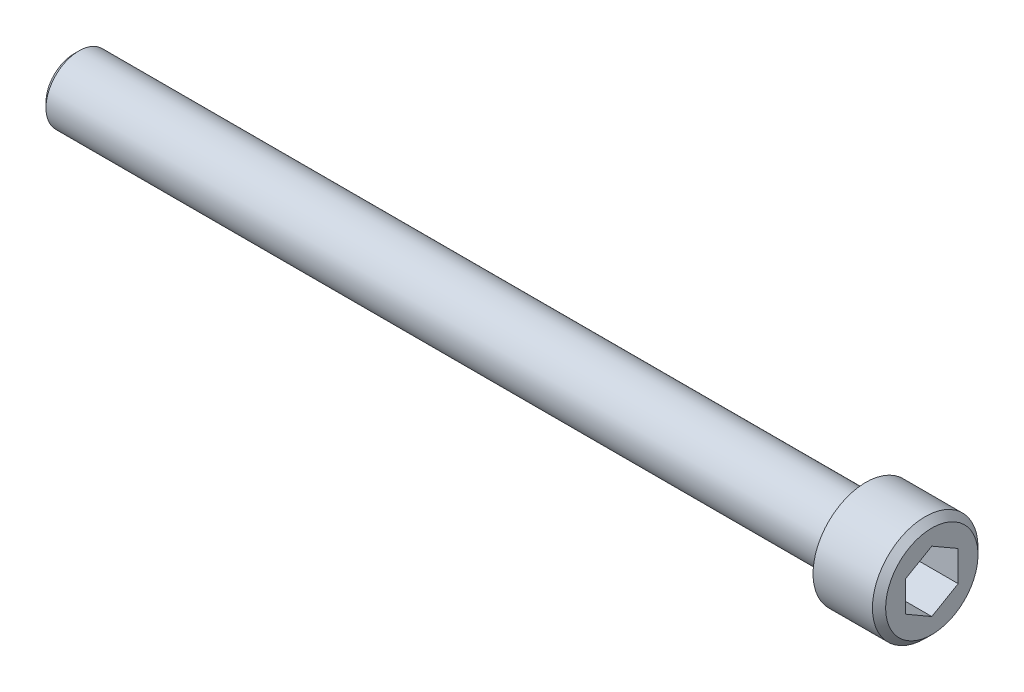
ISO-10303-21;
HEADER;
FILE_DESCRIPTION(('STEP AP214'),'2;1');
FILE_NAME('part.step','',(''),(''),'','','');
FILE_SCHEMA(('AUTOMOTIVE_DESIGN { 1 0 10303 214 1 1 1 1 }'));
ENDSEC;
DATA;
#1=APPLICATION_CONTEXT('core data for automotive mechanical design processes');
#2=APPLICATION_PROTOCOL_DEFINITION('international standard','automotive_design',2000,#1);
#3=PRODUCT_CONTEXT('',#1,'mechanical');
#4=PRODUCT('Part','Part','',(#3));
#5=PRODUCT_RELATED_PRODUCT_CATEGORY('part','',(#4));
#6=PRODUCT_DEFINITION_FORMATION('','',#4);
#7=PRODUCT_DEFINITION_CONTEXT('part definition',#1,'design');
#8=PRODUCT_DEFINITION('design','',#6,#7);
#9=PRODUCT_DEFINITION_SHAPE('','',#8);
#10=(LENGTH_UNIT() NAMED_UNIT(*) SI_UNIT(.MILLI.,.METRE.));
#11=(NAMED_UNIT(*) PLANE_ANGLE_UNIT() SI_UNIT($,.RADIAN.));
#12=(NAMED_UNIT(*) SI_UNIT($,.STERADIAN.) SOLID_ANGLE_UNIT());
#13=UNCERTAINTY_MEASURE_WITH_UNIT(LENGTH_MEASURE(1.E-05),#10,'distance_accuracy_value','');
#14=(GEOMETRIC_REPRESENTATION_CONTEXT(3) GLOBAL_UNCERTAINTY_ASSIGNED_CONTEXT((#13)) GLOBAL_UNIT_ASSIGNED_CONTEXT((#10,
#11,#12)) REPRESENTATION_CONTEXT('',''));
#15=CARTESIAN_POINT('',(0.,0.,0.));
#16=DIRECTION('',(0.,0.,1.));
#17=DIRECTION('',(1.,0.,0.));
#18=AXIS2_PLACEMENT_3D('',#15,#16,#17);
#19=CARTESIAN_POINT('',(124.,0.,0.));
#20=DIRECTION('',(1.,0.,0.));
#21=DIRECTION('',(0.,0.,-1.));
#22=AXIS2_PLACEMENT_3D('',#19,#20,#21);
#23=PLANE('',#22);
#24=DIRECTION('',(0.,-0.5,0.866025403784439));
#25=VECTOR('',#24,1.);
#26=CARTESIAN_POINT('',(124.,4.61880215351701,0.));
#27=LINE('',#26,#25);
#28=CARTESIAN_POINT('',(124.,4.61880215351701,0.));
#29=VERTEX_POINT('',#28);
#30=CARTESIAN_POINT('',(124.,2.3094010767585,4.));
#31=VERTEX_POINT('',#30);
#32=EDGE_CURVE('E83',#29,#31,#27,.T.);
#33=ORIENTED_EDGE('',*,*,#32,.T.);
#34=DIRECTION('',(0.,1.,0.));
#35=VECTOR('',#34,1.);
#36=CARTESIAN_POINT('',(124.,2.3094010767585,4.));
#37=LINE('',#36,#35);
#38=CARTESIAN_POINT('',(124.,-2.3094010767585,4.));
#39=VERTEX_POINT('',#38);
#40=EDGE_CURVE('E67',#31,#39,#37,.F.);
#41=ORIENTED_EDGE('',*,*,#40,.T.);
#42=DIRECTION('',(0.,-0.5,-0.866025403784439));
#43=VECTOR('',#42,1.);
#44=CARTESIAN_POINT('',(124.,-2.3094010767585,4.));
#45=LINE('',#44,#43);
#46=CARTESIAN_POINT('',(124.,-4.61880215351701,0.));
#47=VERTEX_POINT('',#46);
#48=EDGE_CURVE('E72',#39,#47,#45,.T.);
#49=ORIENTED_EDGE('',*,*,#48,.T.);
#50=DIRECTION('',(0.,0.5,-0.866025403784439));
#51=VECTOR('',#50,1.);
#52=CARTESIAN_POINT('',(124.,-4.61880215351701,0.));
#53=LINE('',#52,#51);
#54=CARTESIAN_POINT('',(124.,-2.3094010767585,-4.));
#55=VERTEX_POINT('',#54);
#56=EDGE_CURVE('E128',#47,#55,#53,.T.);
#57=ORIENTED_EDGE('',*,*,#56,.T.);
#58=DIRECTION('',(0.,1.,0.));
#59=VECTOR('',#58,1.);
#60=CARTESIAN_POINT('',(124.,-2.3094010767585,-4.));
#61=LINE('',#60,#59);
#62=CARTESIAN_POINT('',(124.,2.3094010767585,-4.));
#63=VERTEX_POINT('',#62);
#64=EDGE_CURVE('E132',#55,#63,#61,.T.);
#65=ORIENTED_EDGE('',*,*,#64,.T.);
#66=DIRECTION('',(0.,0.5,0.866025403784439));
#67=VECTOR('',#66,1.);
#68=CARTESIAN_POINT('',(124.,2.3094010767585,-4.));
#69=LINE('',#68,#67);
#70=EDGE_CURVE('E137',#63,#29,#69,.T.);
#71=ORIENTED_EDGE('',*,*,#70,.T.);
#72=EDGE_LOOP('',(#33,#41,#49,#57,#65,#71));
#73=FACE_BOUND('',#72,.T.);
#74=ADVANCED_FACE('F17',(#73),#23,.T.);
#75=CARTESIAN_POINT('',(130.,-2.3094010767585,4.));
#76=DIRECTION('',(0.,-0.866025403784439,0.5));
#77=DIRECTION('',(0.,-0.5,-0.866025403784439));
#78=AXIS2_PLACEMENT_3D('',#75,#76,#77);
#79=PLANE('',#78);
#80=DIRECTION('',(1.,0.,0.));
#81=VECTOR('',#80,1.);
#82=CARTESIAN_POINT('',(130.,-2.3094010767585,4.));
#83=LINE('',#82,#81);
#84=CARTESIAN_POINT('',(130.,-2.3094010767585,4.));
#85=VERTEX_POINT('',#84);
#86=EDGE_CURVE('E74',#39,#85,#83,.T.);
#87=ORIENTED_EDGE('',*,*,#86,.T.);
#88=DIRECTION('',(0.,0.5,0.866025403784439));
#89=VECTOR('',#88,1.);
#90=CARTESIAN_POINT('',(130.,-4.61880215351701,0.));
#91=LINE('',#90,#89);
#92=CARTESIAN_POINT('',(130.,-4.61880215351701,0.));
#93=VERTEX_POINT('',#92);
#94=EDGE_CURVE('E126',#93,#85,#91,.T.);
#95=ORIENTED_EDGE('',*,*,#94,.F.);
#96=DIRECTION('',(1.,0.,0.));
#97=VECTOR('',#96,1.);
#98=CARTESIAN_POINT('',(130.,-4.61880215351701,0.));
#99=LINE('',#98,#97);
#100=EDGE_CURVE('E77',#93,#47,#99,.F.);
#101=ORIENTED_EDGE('',*,*,#100,.T.);
#102=ORIENTED_EDGE('',*,*,#48,.F.);
#103=EDGE_LOOP('',(#87,#95,#101,#102));
#104=FACE_BOUND('',#103,.T.);
#105=ADVANCED_FACE('F73',(#104),#79,.F.);
#106=CARTESIAN_POINT('',(130.,2.3094010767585,4.));
#107=DIRECTION('',(0.,0.,1.));
#108=DIRECTION('',(1.,0.,0.));
#109=AXIS2_PLACEMENT_3D('',#106,#107,#108);
#110=PLANE('',#109);
#111=DIRECTION('',(1.,0.,0.));
#112=VECTOR('',#111,1.);
#113=CARTESIAN_POINT('',(130.,2.3094010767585,4.));
#114=LINE('',#113,#112);
#115=CARTESIAN_POINT('',(130.,2.3094010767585,4.));
#116=VERTEX_POINT('',#115);
#117=EDGE_CURVE('E85',#31,#116,#114,.T.);
#118=ORIENTED_EDGE('',*,*,#117,.T.);
#119=DIRECTION('',(0.,1.,0.));
#120=VECTOR('',#119,1.);
#121=CARTESIAN_POINT('',(130.,3.50000000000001,4.));
#122=LINE('',#121,#120);
#123=EDGE_CURVE('E89',#85,#116,#122,.T.);
#124=ORIENTED_EDGE('',*,*,#123,.F.);
#125=ORIENTED_EDGE('',*,*,#86,.F.);
#126=ORIENTED_EDGE('',*,*,#40,.F.);
#127=EDGE_LOOP('',(#118,#124,#125,#126));
#128=FACE_BOUND('',#127,.T.);
#129=ADVANCED_FACE('F87',(#128),#110,.F.);
#130=CARTESIAN_POINT('',(130.,4.61880215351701,0.));
#131=DIRECTION('',(0.,0.866025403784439,0.5));
#132=DIRECTION('',(0.,-0.5,0.866025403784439));
#133=AXIS2_PLACEMENT_3D('',#130,#131,#132);
#134=PLANE('',#133);
#135=DIRECTION('',(1.,0.,0.));
#136=VECTOR('',#135,1.);
#137=CARTESIAN_POINT('',(130.,4.61880215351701,0.));
#138=LINE('',#137,#136);
#139=CARTESIAN_POINT('',(130.,4.61880215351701,0.));
#140=VERTEX_POINT('',#139);
#141=EDGE_CURVE('E139',#29,#140,#138,.T.);
#142=ORIENTED_EDGE('',*,*,#141,.T.);
#143=DIRECTION('',(0.,0.5,-0.866025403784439));
#144=VECTOR('',#143,1.);
#145=CARTESIAN_POINT('',(130.,2.3094010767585,4.));
#146=LINE('',#145,#144);
#147=EDGE_CURVE('E122',#116,#140,#146,.T.);
#148=ORIENTED_EDGE('',*,*,#147,.F.);
#149=ORIENTED_EDGE('',*,*,#117,.F.);
#150=ORIENTED_EDGE('',*,*,#32,.F.);
#151=EDGE_LOOP('',(#142,#148,#149,#150));
#152=FACE_BOUND('',#151,.T.);
#153=ADVANCED_FACE('F143',(#152),#134,.F.);
#154=CARTESIAN_POINT('',(130.,2.3094010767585,-4.));
#155=DIRECTION('',(0.,0.866025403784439,-0.5));
#156=DIRECTION('',(0.,0.5,0.866025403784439));
#157=AXIS2_PLACEMENT_3D('',#154,#155,#156);
#158=PLANE('',#157);
#159=DIRECTION('',(-1.,0.,0.));
#160=VECTOR('',#159,1.);
#161=CARTESIAN_POINT('',(130.,2.3094010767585,-4.));
#162=LINE('',#161,#160);
#163=CARTESIAN_POINT('',(130.,2.3094010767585,-4.));
#164=VERTEX_POINT('',#163);
#165=EDGE_CURVE('E135',#63,#164,#162,.F.);
#166=ORIENTED_EDGE('',*,*,#165,.T.);
#167=DIRECTION('',(0.,-0.5,-0.866025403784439));
#168=VECTOR('',#167,1.);
#169=CARTESIAN_POINT('',(130.,4.61880215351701,0.));
#170=LINE('',#169,#168);
#171=EDGE_CURVE('E119',#140,#164,#170,.T.);
#172=ORIENTED_EDGE('',*,*,#171,.F.);
#173=ORIENTED_EDGE('',*,*,#141,.F.);
#174=ORIENTED_EDGE('',*,*,#70,.F.);
#175=EDGE_LOOP('',(#166,#172,#173,#174));
#176=FACE_BOUND('',#175,.T.);
#177=ADVANCED_FACE('F154',(#176),#158,.F.);
#178=CARTESIAN_POINT('',(130.,-2.3094010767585,-4.));
#179=DIRECTION('',(0.,0.,-1.));
#180=DIRECTION('',(-1.,0.,0.));
#181=AXIS2_PLACEMENT_3D('',#178,#179,#180);
#182=PLANE('',#181);
#183=DIRECTION('',(1.,0.,0.));
#184=VECTOR('',#183,1.);
#185=CARTESIAN_POINT('',(130.,-2.3094010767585,-4.));
#186=LINE('',#185,#184);
#187=CARTESIAN_POINT('',(130.,-2.3094010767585,-4.));
#188=VERTEX_POINT('',#187);
#189=EDGE_CURVE('E35',#55,#188,#186,.T.);
#190=ORIENTED_EDGE('',*,*,#189,.T.);
#191=DIRECTION('',(0.,1.,0.));
#192=VECTOR('',#191,1.);
#193=CARTESIAN_POINT('',(130.,3.50000000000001,-4.));
#194=LINE('',#193,#192);
#195=EDGE_CURVE('E116',#164,#188,#194,.F.);
#196=ORIENTED_EDGE('',*,*,#195,.F.);
#197=ORIENTED_EDGE('',*,*,#165,.F.);
#198=ORIENTED_EDGE('',*,*,#64,.F.);
#199=EDGE_LOOP('',(#190,#196,#197,#198));
#200=FACE_BOUND('',#199,.T.);
#201=ADVANCED_FACE('F152',(#200),#182,.F.);
#202=CARTESIAN_POINT('',(130.,-4.61880215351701,0.));
#203=DIRECTION('',(0.,-0.866025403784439,-0.5));
#204=DIRECTION('',(0.,0.5,-0.866025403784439));
#205=AXIS2_PLACEMENT_3D('',#202,#203,#204);
#206=PLANE('',#205);
#207=ORIENTED_EDGE('',*,*,#100,.F.);
#208=DIRECTION('',(0.,-0.5,0.866025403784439));
#209=VECTOR('',#208,1.);
#210=CARTESIAN_POINT('',(130.,-2.3094010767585,-4.));
#211=LINE('',#210,#209);
#212=EDGE_CURVE('E108',#188,#93,#211,.T.);
#213=ORIENTED_EDGE('',*,*,#212,.F.);
#214=ORIENTED_EDGE('',*,*,#189,.F.);
#215=ORIENTED_EDGE('',*,*,#56,.F.);
#216=EDGE_LOOP('',(#207,#213,#214,#215));
#217=FACE_BOUND('',#216,.T.);
#218=ADVANCED_FACE('F150',(#217),#206,.F.);
#219=CARTESIAN_POINT('',(130.,3.50000000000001,0.));
#220=DIRECTION('',(1.,0.,0.));
#221=DIRECTION('',(0.,0.,-1.));
#222=AXIS2_PLACEMENT_3D('',#219,#220,#221);
#223=PLANE('',#222);
#224=ORIENTED_EDGE('',*,*,#195,.T.);
#225=ORIENTED_EDGE('',*,*,#212,.T.);
#226=ORIENTED_EDGE('',*,*,#94,.T.);
#227=ORIENTED_EDGE('',*,*,#123,.T.);
#228=ORIENTED_EDGE('',*,*,#147,.T.);
#229=ORIENTED_EDGE('',*,*,#171,.T.);
#230=EDGE_LOOP('',(#224,#225,#226,#227,#228,#229));
#231=FACE_BOUND('',#230,.T.);
#232=CARTESIAN_POINT('',(130.000000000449,0.,0.));
#233=DIRECTION('',(-1.,0.,0.));
#234=DIRECTION('',(0.,0.,1.));
#235=AXIS2_PLACEMENT_3D('',#232,#233,#234);
#236=CIRCLE('',#235,7.00000000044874);
#237=CARTESIAN_POINT('',(130.000000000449,0.,7.00000000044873));
#238=VERTEX_POINT('',#237);
#239=EDGE_CURVE('E20',#238,#238,#236,.T.);
#240=ORIENTED_EDGE('',*,*,#239,.F.);
#241=EDGE_LOOP('',(#240));
#242=FACE_BOUND('',#241,.T.);
#243=ADVANCED_FACE('F147',(#231,#242),#223,.T.);
#244=CARTESIAN_POINT('',(128.999999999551,0.,0.));
#245=DIRECTION('',(-1.,0.,0.));
#246=DIRECTION('',(0.,0.,1.));
#247=AXIS2_PLACEMENT_3D('',#244,#245,#246);
#248=CONICAL_SURFACE('',#247,7.99999999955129,0.785398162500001);
#249=CARTESIAN_POINT('',(129.,0.,0.));
#250=DIRECTION('',(1.,0.,0.));
#251=DIRECTION('',(0.,0.,-1.));
#252=AXIS2_PLACEMENT_3D('',#249,#250,#251);
#253=CIRCLE('',#252,8.00000000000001);
#254=CARTESIAN_POINT('',(129.,0.,-8.00000000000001));
#255=VERTEX_POINT('',#254);
#256=EDGE_CURVE('E100',#255,#255,#253,.F.);
#257=ORIENTED_EDGE('',*,*,#256,.F.);
#258=EDGE_LOOP('',(#257));
#259=FACE_BOUND('',#258,.T.);
#260=ORIENTED_EDGE('',*,*,#239,.T.);
#261=EDGE_LOOP('',(#260));
#262=FACE_BOUND('',#261,.T.);
#263=ADVANCED_FACE('F187',(#259,#262),#248,.T.);
#264=CARTESIAN_POINT('',(124.5,0.,0.));
#265=DIRECTION('',(1.,0.,0.));
#266=DIRECTION('',(0.,0.,-1.));
#267=AXIS2_PLACEMENT_3D('',#264,#265,#266);
#268=CYLINDRICAL_SURFACE('',#267,8.00000000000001);
#269=CARTESIAN_POINT('',(120.,0.,0.));
#270=DIRECTION('',(1.,0.,0.));
#271=DIRECTION('',(0.,0.,-1.));
#272=AXIS2_PLACEMENT_3D('',#269,#270,#271);
#273=CIRCLE('',#272,8.00000000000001);
#274=CARTESIAN_POINT('',(120.,0.,-8.00000000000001));
#275=VERTEX_POINT('',#274);
#276=EDGE_CURVE('E98',#275,#275,#273,.F.);
#277=ORIENTED_EDGE('',*,*,#276,.F.);
#278=EDGE_LOOP('',(#277));
#279=FACE_BOUND('',#278,.T.);
#280=ORIENTED_EDGE('',*,*,#256,.T.);
#281=EDGE_LOOP('',(#280));
#282=FACE_BOUND('',#281,.T.);
#283=ADVANCED_FACE('F183',(#279,#282),#268,.T.);
#284=CARTESIAN_POINT('',(0.,2.125,0.));
#285=DIRECTION('',(-1.,0.,0.));
#286=DIRECTION('',(0.,0.,1.));
#287=AXIS2_PLACEMENT_3D('',#284,#285,#286);
#288=PLANE('',#287);
#289=CARTESIAN_POINT('',(-2.8421709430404E-10,0.,0.));
#290=DIRECTION('',(1.,0.,0.));
#291=DIRECTION('',(0.,0.,-1.));
#292=AXIS2_PLACEMENT_3D('',#289,#290,#291);
#293=CIRCLE('',#292,4.25000000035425);
#294=CARTESIAN_POINT('',(-2.8421709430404E-10,0.,-4.25000000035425));
#295=VERTEX_POINT('',#294);
#296=EDGE_CURVE('E96',#295,#295,#293,.T.);
#297=ORIENTED_EDGE('',*,*,#296,.F.);
#298=EDGE_LOOP('',(#297));
#299=FACE_BOUND('',#298,.T.);
#300=ADVANCED_FACE('F179',(#299),#288,.T.);
#301=CARTESIAN_POINT('',(120.,6.50000000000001,0.));
#302=DIRECTION('',(-1.,0.,0.));
#303=DIRECTION('',(0.,0.,1.));
#304=AXIS2_PLACEMENT_3D('',#301,#302,#303);
#305=PLANE('',#304);
#306=CARTESIAN_POINT('',(120.,0.,0.));
#307=DIRECTION('',(1.,0.,0.));
#308=DIRECTION('',(0.,0.,-1.));
#309=AXIS2_PLACEMENT_3D('',#306,#307,#308);
#310=CIRCLE('',#309,5.00000000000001);
#311=CARTESIAN_POINT('',(120.,0.,-5.00000000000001));
#312=VERTEX_POINT('',#311);
#313=EDGE_CURVE('E26',#312,#312,#310,.F.);
#314=ORIENTED_EDGE('',*,*,#313,.F.);
#315=EDGE_LOOP('',(#314));
#316=FACE_BOUND('',#315,.T.);
#317=ORIENTED_EDGE('',*,*,#276,.T.);
#318=EDGE_LOOP('',(#317));
#319=FACE_BOUND('',#318,.T.);
#320=ADVANCED_FACE('F172',(#316,#319),#305,.T.);
#321=CARTESIAN_POINT('',(0.750000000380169,0.,0.));
#322=DIRECTION('',(1.,0.,0.));
#323=DIRECTION('',(0.,0.,-1.));
#324=AXIS2_PLACEMENT_3D('',#321,#322,#323);
#325=CONICAL_SURFACE('',#324,4.99999999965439,0.785398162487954);
#326=ORIENTED_EDGE('',*,*,#296,.T.);
#327=EDGE_LOOP('',(#326));
#328=FACE_BOUND('',#327,.T.);
#329=CARTESIAN_POINT('',(0.750000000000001,0.,0.));
#330=DIRECTION('',(1.,0.,0.));
#331=DIRECTION('',(0.,0.,-1.));
#332=AXIS2_PLACEMENT_3D('',#329,#330,#331);
#333=CIRCLE('',#332,5.00000000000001);
#334=CARTESIAN_POINT('',(0.750000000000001,0.,-5.00000000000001));
#335=VERTEX_POINT('',#334);
#336=EDGE_CURVE('E11',#335,#335,#333,.T.);
#337=ORIENTED_EDGE('',*,*,#336,.F.);
#338=EDGE_LOOP('',(#337));
#339=FACE_BOUND('',#338,.T.);
#340=ADVANCED_FACE('F166',(#328,#339),#325,.T.);
#341=CARTESIAN_POINT('',(60.375,0.,0.));
#342=DIRECTION('',(1.,0.,0.));
#343=DIRECTION('',(0.,0.,-1.));
#344=AXIS2_PLACEMENT_3D('',#341,#342,#343);
#345=CYLINDRICAL_SURFACE('',#344,5.00000000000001);
#346=ORIENTED_EDGE('',*,*,#336,.T.);
#347=EDGE_LOOP('',(#346));
#348=FACE_BOUND('',#347,.T.);
#349=ORIENTED_EDGE('',*,*,#313,.T.);
#350=EDGE_LOOP('',(#349));
#351=FACE_BOUND('',#350,.T.);
#352=ADVANCED_FACE('F164',(#348,#351),#345,.T.);
#353=CLOSED_SHELL('',(#74,#105,#129,#153,#177,#201,#218,#243,#263,#283,#300,#320,#340,#352));
#354=MANIFOLD_SOLID_BREP('B1',#353);
#355=ADVANCED_BREP_SHAPE_REPRESENTATION('',(#18,#354),#14);
#356=SHAPE_DEFINITION_REPRESENTATION(#9,#355);
ENDSEC;
END-ISO-10303-21;
